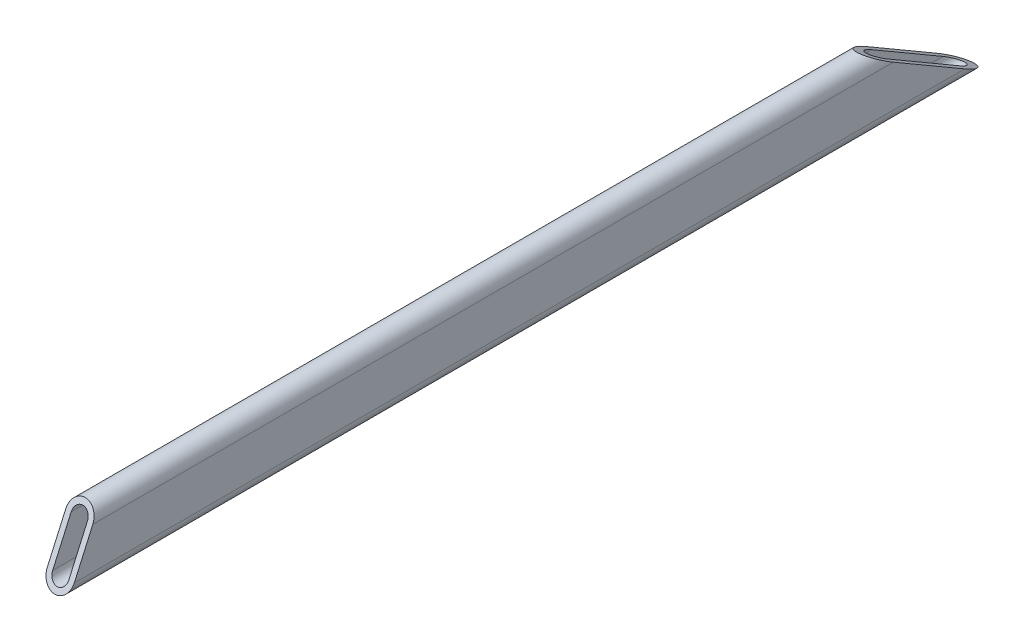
ISO-10303-21;
HEADER;
FILE_DESCRIPTION(('STEP AP214'),'2;1');
FILE_NAME('part.step','',(''),(''),'','','');
FILE_SCHEMA(('AUTOMOTIVE_DESIGN { 1 0 10303 214 1 1 1 1 }'));
ENDSEC;
DATA;
#1=APPLICATION_CONTEXT('core data for automotive mechanical design processes');
#2=APPLICATION_PROTOCOL_DEFINITION('international standard','automotive_design',2000,#1);
#3=PRODUCT_CONTEXT('',#1,'mechanical');
#4=PRODUCT('Part','Part','',(#3));
#5=PRODUCT_RELATED_PRODUCT_CATEGORY('part','',(#4));
#6=PRODUCT_DEFINITION_FORMATION('','',#4);
#7=PRODUCT_DEFINITION_CONTEXT('part definition',#1,'design');
#8=PRODUCT_DEFINITION('design','',#6,#7);
#9=PRODUCT_DEFINITION_SHAPE('','',#8);
#10=(LENGTH_UNIT() NAMED_UNIT(*) SI_UNIT(.MILLI.,.METRE.));
#11=(NAMED_UNIT(*) PLANE_ANGLE_UNIT() SI_UNIT($,.RADIAN.));
#12=(NAMED_UNIT(*) SI_UNIT($,.STERADIAN.) SOLID_ANGLE_UNIT());
#13=UNCERTAINTY_MEASURE_WITH_UNIT(LENGTH_MEASURE(1.E-05),#10,'distance_accuracy_value','');
#14=(GEOMETRIC_REPRESENTATION_CONTEXT(3) GLOBAL_UNCERTAINTY_ASSIGNED_CONTEXT((#13)) GLOBAL_UNIT_ASSIGNED_CONTEXT((#10,
#11,#12)) REPRESENTATION_CONTEXT('',''));
#15=CARTESIAN_POINT('',(0.,0.,0.));
#16=DIRECTION('',(0.,0.,1.));
#17=DIRECTION('',(1.,0.,0.));
#18=AXIS2_PLACEMENT_3D('',#15,#16,#17);
#19=CARTESIAN_POINT('',(0.,10.5,255.));
#20=DIRECTION('',(0.,0.,-1.));
#21=DIRECTION('',(-1.,0.,0.));
#22=AXIS2_PLACEMENT_3D('',#19,#20,#21);
#23=CYLINDRICAL_SURFACE('',#22,7.5);
#24=DIRECTION('',(0.,0.,-1.));
#25=VECTOR('',#24,1.);
#26=CARTESIAN_POINT('',(7.5,10.5,255.));
#27=LINE('',#26,#25);
#28=CARTESIAN_POINT('',(7.5,10.5,241.42052509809));
#29=VERTEX_POINT('',#28);
#30=CARTESIAN_POINT('',(7.5,10.5,-202.595753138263));
#31=VERTEX_POINT('',#30);
#32=EDGE_CURVE('E118',#29,#31,#27,.T.);
#33=ORIENTED_EDGE('',*,*,#32,.T.);
#34=CARTESIAN_POINT('',(0.,10.5,-202.595753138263));
#35=DIRECTION('',(0.,-0.864274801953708,0.50301994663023));
#36=DIRECTION('',(0.,-0.50301994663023,-0.864274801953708));
#37=AXIS2_PLACEMENT_3D('',#34,#35,#36);
#38=ELLIPSE('',#37,14.9099455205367,7.5);
#39=CARTESIAN_POINT('',(-7.5,10.5,-202.595753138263));
#40=VERTEX_POINT('',#39);
#41=EDGE_CURVE('E48',#31,#40,#38,.T.);
#42=ORIENTED_EDGE('',*,*,#41,.T.);
#43=DIRECTION('',(0.,0.,-1.));
#44=VECTOR('',#43,1.);
#45=CARTESIAN_POINT('',(-7.5,10.5,255.));
#46=LINE('',#45,#44);
#47=CARTESIAN_POINT('',(-7.5,10.5,241.42052509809));
#48=VERTEX_POINT('',#47);
#49=EDGE_CURVE('E120',#48,#40,#46,.T.);
#50=ORIENTED_EDGE('',*,*,#49,.F.);
#51=CARTESIAN_POINT('',(0.,10.5,241.42052509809));
#52=DIRECTION('',(0.,-0.406736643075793,-0.913545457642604));
#53=DIRECTION('',(0.,0.913545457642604,-0.406736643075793));
#54=AXIS2_PLACEMENT_3D('',#51,#52,#53);
#55=ELLIPSE('',#54,8.20977208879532,7.5);
#56=EDGE_CURVE('E154',#48,#29,#55,.T.);
#57=ORIENTED_EDGE('',*,*,#56,.T.);
#58=EDGE_LOOP('',(#33,#42,#50,#57));
#59=FACE_BOUND('',#58,.T.);
#60=ADVANCED_FACE('F34',(#59),#23,.T.);
#61=CARTESIAN_POINT('',(-7.5,10.5,255.));
#62=DIRECTION('',(1.,0.,0.));
#63=DIRECTION('',(0.,0.,-1.));
#64=AXIS2_PLACEMENT_3D('',#61,#62,#63);
#65=PLANE('',#64);
#66=ORIENTED_EDGE('',*,*,#49,.T.);
#67=DIRECTION('',(0.,-0.50301994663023,-0.864274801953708));
#68=VECTOR('',#67,1.);
#69=CARTESIAN_POINT('',(-7.5,-20.,-255.));
#70=LINE('',#69,#68);
#71=CARTESIAN_POINT('',(-7.5,-12.5,-242.113709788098));
#72=VERTEX_POINT('',#71);
#73=EDGE_CURVE('E112',#40,#72,#70,.T.);
#74=ORIENTED_EDGE('',*,*,#73,.T.);
#75=DIRECTION('',(0.,0.,-1.));
#76=VECTOR('',#75,1.);
#77=CARTESIAN_POINT('',(-7.5,-12.5,255.));
#78=LINE('',#77,#76);
#79=CARTESIAN_POINT('',(-7.5,-12.5,251.660784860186));
#80=VERTEX_POINT('',#79);
#81=EDGE_CURVE('E103',#80,#72,#78,.T.);
#82=ORIENTED_EDGE('',*,*,#81,.F.);
#83=DIRECTION('',(0.,0.913545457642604,-0.406736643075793));
#84=VECTOR('',#83,1.);
#85=CARTESIAN_POINT('',(-7.5,-20.,255.));
#86=LINE('',#85,#84);
#87=EDGE_CURVE('E148',#80,#48,#86,.T.);
#88=ORIENTED_EDGE('',*,*,#87,.T.);
#89=EDGE_LOOP('',(#66,#74,#82,#88));
#90=FACE_BOUND('',#89,.T.);
#91=ADVANCED_FACE('F181',(#90),#65,.F.);
#92=CARTESIAN_POINT('',(0.,-12.5,255.));
#93=DIRECTION('',(0.,0.,-1.));
#94=DIRECTION('',(-1.,0.,0.));
#95=AXIS2_PLACEMENT_3D('',#92,#93,#94);
#96=CYLINDRICAL_SURFACE('',#95,7.5);
#97=CARTESIAN_POINT('',(0.,-12.5,-242.113709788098));
#98=DIRECTION('',(0.,-0.864274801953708,0.50301994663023));
#99=DIRECTION('',(0.,-0.50301994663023,-0.864274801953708));
#100=AXIS2_PLACEMENT_3D('',#97,#98,#99);
#101=ELLIPSE('',#100,14.9099455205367,7.5);
#102=CARTESIAN_POINT('',(7.5,-12.5,-242.113709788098));
#103=VERTEX_POINT('',#102);
#104=EDGE_CURVE('E98',#72,#103,#101,.T.);
#105=ORIENTED_EDGE('',*,*,#104,.T.);
#106=DIRECTION('',(0.,0.,-1.));
#107=VECTOR('',#106,1.);
#108=CARTESIAN_POINT('',(7.5,-12.5,255.));
#109=LINE('',#108,#107);
#110=CARTESIAN_POINT('',(7.5,-12.5,251.660784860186));
#111=VERTEX_POINT('',#110);
#112=EDGE_CURVE('E101',#111,#103,#109,.T.);
#113=ORIENTED_EDGE('',*,*,#112,.F.);
#114=CARTESIAN_POINT('',(0.,-12.5,251.660784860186));
#115=DIRECTION('',(0.,-0.406736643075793,-0.913545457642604));
#116=DIRECTION('',(0.,0.913545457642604,-0.406736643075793));
#117=AXIS2_PLACEMENT_3D('',#114,#115,#116);
#118=ELLIPSE('',#117,8.20977208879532,7.5);
#119=EDGE_CURVE('E176',#111,#80,#118,.T.);
#120=ORIENTED_EDGE('',*,*,#119,.T.);
#121=ORIENTED_EDGE('',*,*,#81,.T.);
#122=EDGE_LOOP('',(#105,#113,#120,#121));
#123=FACE_BOUND('',#122,.T.);
#124=ADVANCED_FACE('F99',(#123),#96,.T.);
#125=CARTESIAN_POINT('',(7.5,10.5,255.));
#126=DIRECTION('',(-1.,0.,0.));
#127=DIRECTION('',(0.,0.,1.));
#128=AXIS2_PLACEMENT_3D('',#125,#126,#127);
#129=PLANE('',#128);
#130=ORIENTED_EDGE('',*,*,#112,.T.);
#131=DIRECTION('',(0.,-0.50301994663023,-0.864274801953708));
#132=VECTOR('',#131,1.);
#133=CARTESIAN_POINT('',(7.5,-20.,-255.));
#134=LINE('',#133,#132);
#135=EDGE_CURVE('E107',#31,#103,#134,.T.);
#136=ORIENTED_EDGE('',*,*,#135,.F.);
#137=ORIENTED_EDGE('',*,*,#32,.F.);
#138=DIRECTION('',(0.,0.913545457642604,-0.406736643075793));
#139=VECTOR('',#138,1.);
#140=CARTESIAN_POINT('',(7.5,-20.,255.));
#141=LINE('',#140,#139);
#142=EDGE_CURVE('E117',#111,#29,#141,.T.);
#143=ORIENTED_EDGE('',*,*,#142,.F.);
#144=EDGE_LOOP('',(#130,#136,#137,#143));
#145=FACE_BOUND('',#144,.T.);
#146=ADVANCED_FACE('F115',(#145),#129,.F.);
#147=CARTESIAN_POINT('',(0.,10.5,255.));
#148=DIRECTION('',(0.,0.,-1.));
#149=DIRECTION('',(-1.,0.,0.));
#150=AXIS2_PLACEMENT_3D('',#147,#148,#149);
#151=CYLINDRICAL_SURFACE('',#150,4.5);
#152=CARTESIAN_POINT('',(0.,10.5,-202.595753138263));
#153=DIRECTION('',(0.,-0.864274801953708,0.50301994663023));
#154=DIRECTION('',(0.,-0.50301994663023,-0.864274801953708));
#155=AXIS2_PLACEMENT_3D('',#152,#153,#154);
#156=ELLIPSE('',#155,8.94596731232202,4.5);
#157=CARTESIAN_POINT('',(4.5,10.5,-202.595753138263));
#158=VERTEX_POINT('',#157);
#159=CARTESIAN_POINT('',(-4.5,10.5,-202.595753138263));
#160=VERTEX_POINT('',#159);
#161=EDGE_CURVE('E105',#158,#160,#156,.T.);
#162=ORIENTED_EDGE('',*,*,#161,.F.);
#163=DIRECTION('',(0.,0.,-1.));
#164=VECTOR('',#163,1.);
#165=CARTESIAN_POINT('',(4.5,10.5,255.));
#166=LINE('',#165,#164);
#167=CARTESIAN_POINT('',(4.5,10.5,241.42052509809));
#168=VERTEX_POINT('',#167);
#169=EDGE_CURVE('E151',#168,#158,#166,.T.);
#170=ORIENTED_EDGE('',*,*,#169,.F.);
#171=CARTESIAN_POINT('',(0.,10.5,241.42052509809));
#172=DIRECTION('',(0.,-0.406736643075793,-0.913545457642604));
#173=DIRECTION('',(0.,0.913545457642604,-0.406736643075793));
#174=AXIS2_PLACEMENT_3D('',#171,#172,#173);
#175=ELLIPSE('',#174,4.92586325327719,4.5);
#176=CARTESIAN_POINT('',(-4.5,10.5,241.42052509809));
#177=VERTEX_POINT('',#176);
#178=EDGE_CURVE('E135',#177,#168,#175,.T.);
#179=ORIENTED_EDGE('',*,*,#178,.F.);
#180=DIRECTION('',(0.,0.,-1.));
#181=VECTOR('',#180,1.);
#182=CARTESIAN_POINT('',(-4.5,10.5,255.));
#183=LINE('',#182,#181);
#184=EDGE_CURVE('E122',#177,#160,#183,.T.);
#185=ORIENTED_EDGE('',*,*,#184,.T.);
#186=EDGE_LOOP('',(#162,#170,#179,#185));
#187=FACE_BOUND('',#186,.T.);
#188=ADVANCED_FACE('F161',(#187),#151,.F.);
#189=CARTESIAN_POINT('',(-4.5,10.5,255.));
#190=DIRECTION('',(1.,0.,0.));
#191=DIRECTION('',(0.,1.,0.));
#192=AXIS2_PLACEMENT_3D('',#189,#190,#191);
#193=PLANE('',#192);
#194=DIRECTION('',(0.,-0.50301994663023,-0.864274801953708));
#195=VECTOR('',#194,1.);
#196=CARTESIAN_POINT('',(-4.49999999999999,209.43859355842,139.214973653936));
#197=LINE('',#196,#195);
#198=CARTESIAN_POINT('',(-4.5,-12.5,-242.113709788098));
#199=VERTEX_POINT('',#198);
#200=EDGE_CURVE('E165',#160,#199,#197,.T.);
#201=ORIENTED_EDGE('',*,*,#200,.F.);
#202=ORIENTED_EDGE('',*,*,#184,.F.);
#203=DIRECTION('',(0.,0.913545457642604,-0.406736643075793));
#204=VECTOR('',#203,1.);
#205=CARTESIAN_POINT('',(-4.5,5.45424174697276,243.66704141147));
#206=LINE('',#205,#204);
#207=CARTESIAN_POINT('',(-4.5,-12.5,251.660784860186));
#208=VERTEX_POINT('',#207);
#209=EDGE_CURVE('E147',#208,#177,#206,.T.);
#210=ORIENTED_EDGE('',*,*,#209,.F.);
#211=DIRECTION('',(0.,0.,-1.));
#212=VECTOR('',#211,1.);
#213=CARTESIAN_POINT('',(-4.5,-12.5,255.));
#214=LINE('',#213,#212);
#215=EDGE_CURVE('E146',#208,#199,#214,.T.);
#216=ORIENTED_EDGE('',*,*,#215,.T.);
#217=EDGE_LOOP('',(#201,#202,#210,#216));
#218=FACE_BOUND('',#217,.T.);
#219=ADVANCED_FACE('F164',(#218),#193,.T.);
#220=CARTESIAN_POINT('',(0.,-12.5,255.));
#221=DIRECTION('',(0.,0.,-1.));
#222=DIRECTION('',(-1.,0.,0.));
#223=AXIS2_PLACEMENT_3D('',#220,#221,#222);
#224=CYLINDRICAL_SURFACE('',#223,4.5);
#225=CARTESIAN_POINT('',(0.,-12.5,-242.113709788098));
#226=DIRECTION('',(0.,-0.864274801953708,0.50301994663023));
#227=DIRECTION('',(0.,-0.50301994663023,-0.864274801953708));
#228=AXIS2_PLACEMENT_3D('',#225,#226,#227);
#229=ELLIPSE('',#228,8.94596731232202,4.5);
#230=CARTESIAN_POINT('',(4.5,-12.5,-242.113709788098));
#231=VERTEX_POINT('',#230);
#232=EDGE_CURVE('E55',#199,#231,#229,.T.);
#233=ORIENTED_EDGE('',*,*,#232,.F.);
#234=ORIENTED_EDGE('',*,*,#215,.F.);
#235=CARTESIAN_POINT('',(0.,-12.5,251.660784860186));
#236=DIRECTION('',(0.,-0.406736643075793,-0.913545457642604));
#237=DIRECTION('',(0.,0.913545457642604,-0.406736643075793));
#238=AXIS2_PLACEMENT_3D('',#235,#236,#237);
#239=ELLIPSE('',#238,4.92586325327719,4.5);
#240=CARTESIAN_POINT('',(4.5,-12.5,251.660784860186));
#241=VERTEX_POINT('',#240);
#242=EDGE_CURVE('E132',#241,#208,#239,.T.);
#243=ORIENTED_EDGE('',*,*,#242,.F.);
#244=DIRECTION('',(0.,0.,-1.));
#245=VECTOR('',#244,1.);
#246=CARTESIAN_POINT('',(4.5,-12.5,255.));
#247=LINE('',#246,#245);
#248=EDGE_CURVE('E144',#241,#231,#247,.T.);
#249=ORIENTED_EDGE('',*,*,#248,.T.);
#250=EDGE_LOOP('',(#233,#234,#243,#249));
#251=FACE_BOUND('',#250,.T.);
#252=ADVANCED_FACE('F143',(#251),#224,.F.);
#253=CARTESIAN_POINT('',(4.5,10.5,255.));
#254=DIRECTION('',(-1.,0.,0.));
#255=DIRECTION('',(0.,0.,1.));
#256=AXIS2_PLACEMENT_3D('',#253,#254,#255);
#257=PLANE('',#256);
#258=DIRECTION('',(0.,0.50301994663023,0.864274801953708));
#259=VECTOR('',#258,1.);
#260=CARTESIAN_POINT('',(4.5,209.43859355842,139.214973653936));
#261=LINE('',#260,#259);
#262=EDGE_CURVE('E11',#231,#158,#261,.T.);
#263=ORIENTED_EDGE('',*,*,#262,.F.);
#264=ORIENTED_EDGE('',*,*,#248,.F.);
#265=DIRECTION('',(0.,-0.913545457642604,0.406736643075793));
#266=VECTOR('',#265,1.);
#267=CARTESIAN_POINT('',(4.5,5.45424174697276,243.66704141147));
#268=LINE('',#267,#266);
#269=EDGE_CURVE('E41',#168,#241,#268,.T.);
#270=ORIENTED_EDGE('',*,*,#269,.F.);
#271=ORIENTED_EDGE('',*,*,#169,.T.);
#272=EDGE_LOOP('',(#263,#264,#270,#271));
#273=FACE_BOUND('',#272,.T.);
#274=ADVANCED_FACE('F150',(#273),#257,.T.);
#275=CARTESIAN_POINT('',(-7.5,-20.,255.));
#276=DIRECTION('',(0.,-0.406736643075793,-0.913545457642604));
#277=DIRECTION('',(0.,0.913545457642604,-0.406736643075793));
#278=AXIS2_PLACEMENT_3D('',#275,#276,#277);
#279=PLANE('',#278);
#280=ORIENTED_EDGE('',*,*,#178,.T.);
#281=ORIENTED_EDGE('',*,*,#269,.T.);
#282=ORIENTED_EDGE('',*,*,#242,.T.);
#283=ORIENTED_EDGE('',*,*,#209,.T.);
#284=EDGE_LOOP('',(#280,#281,#282,#283));
#285=FACE_BOUND('',#284,.T.);
#286=ORIENTED_EDGE('',*,*,#56,.F.);
#287=ORIENTED_EDGE('',*,*,#87,.F.);
#288=ORIENTED_EDGE('',*,*,#119,.F.);
#289=ORIENTED_EDGE('',*,*,#142,.T.);
#290=EDGE_LOOP('',(#286,#287,#288,#289));
#291=FACE_BOUND('',#290,.T.);
#292=ADVANCED_FACE('F130',(#285,#291),#279,.F.);
#293=CARTESIAN_POINT('',(-7.5,-20.,-255.));
#294=DIRECTION('',(0.,-0.864274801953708,0.50301994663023));
#295=DIRECTION('',(0.,-0.50301994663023,-0.864274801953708));
#296=AXIS2_PLACEMENT_3D('',#293,#294,#295);
#297=PLANE('',#296);
#298=ORIENTED_EDGE('',*,*,#161,.T.);
#299=ORIENTED_EDGE('',*,*,#200,.T.);
#300=ORIENTED_EDGE('',*,*,#232,.T.);
#301=ORIENTED_EDGE('',*,*,#262,.T.);
#302=EDGE_LOOP('',(#298,#299,#300,#301));
#303=FACE_BOUND('',#302,.T.);
#304=ORIENTED_EDGE('',*,*,#135,.T.);
#305=ORIENTED_EDGE('',*,*,#104,.F.);
#306=ORIENTED_EDGE('',*,*,#73,.F.);
#307=ORIENTED_EDGE('',*,*,#41,.F.);
#308=EDGE_LOOP('',(#304,#305,#306,#307));
#309=FACE_BOUND('',#308,.T.);
#310=ADVANCED_FACE('F108',(#303,#309),#297,.F.);
#311=CLOSED_SHELL('',(#60,#91,#124,#146,#188,#219,#252,#274,#292,#310));
#312=MANIFOLD_SOLID_BREP('B2',#311);
#313=ADVANCED_BREP_SHAPE_REPRESENTATION('',(#18,#312),#14);
#314=SHAPE_DEFINITION_REPRESENTATION(#9,#313);
ENDSEC;
END-ISO-10303-21;
